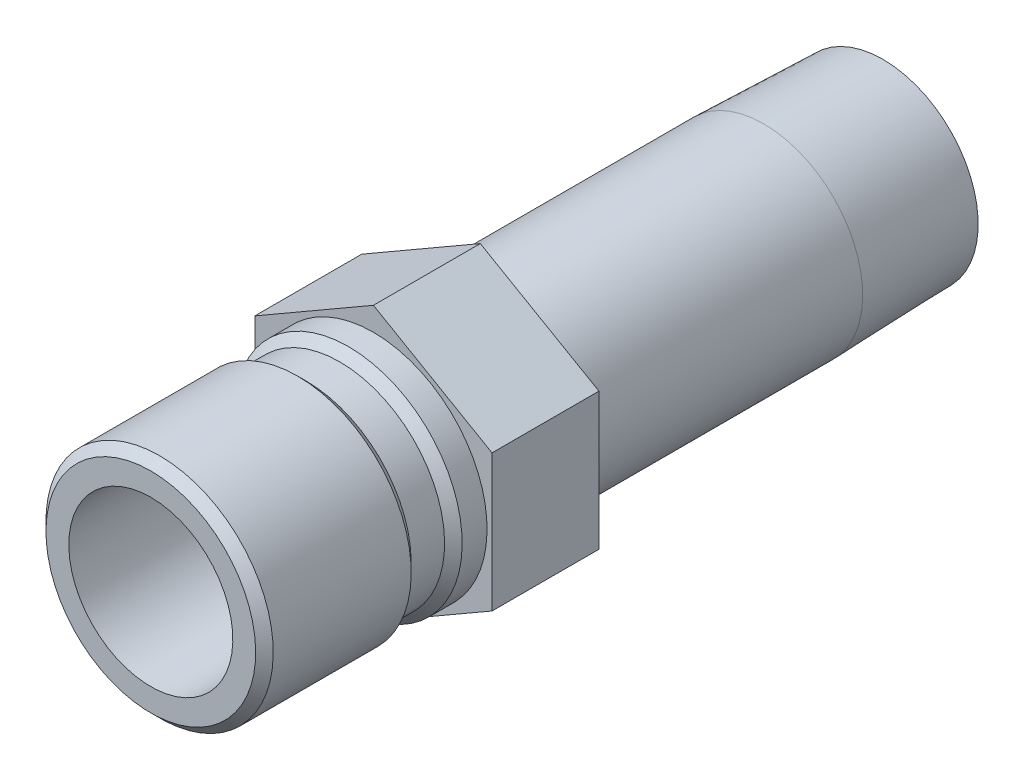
ISO-10303-21;
HEADER;
FILE_DESCRIPTION(('STEP AP214'),'2;1');
FILE_NAME('part.step','',(''),(''),'','','');
FILE_SCHEMA(('AUTOMOTIVE_DESIGN { 1 0 10303 214 1 1 1 1 }'));
ENDSEC;
DATA;
#1=APPLICATION_CONTEXT('core data for automotive mechanical design processes');
#2=APPLICATION_PROTOCOL_DEFINITION('international standard','automotive_design',2000,#1);
#3=PRODUCT_CONTEXT('',#1,'mechanical');
#4=PRODUCT('Part','Part','',(#3));
#5=PRODUCT_RELATED_PRODUCT_CATEGORY('part','',(#4));
#6=PRODUCT_DEFINITION_FORMATION('','',#4);
#7=PRODUCT_DEFINITION_CONTEXT('part definition',#1,'design');
#8=PRODUCT_DEFINITION('design','',#6,#7);
#9=PRODUCT_DEFINITION_SHAPE('','',#8);
#10=(LENGTH_UNIT() NAMED_UNIT(*) SI_UNIT(.MILLI.,.METRE.));
#11=(NAMED_UNIT(*) PLANE_ANGLE_UNIT() SI_UNIT($,.RADIAN.));
#12=(NAMED_UNIT(*) SI_UNIT($,.STERADIAN.) SOLID_ANGLE_UNIT());
#13=UNCERTAINTY_MEASURE_WITH_UNIT(LENGTH_MEASURE(1.E-05),#10,'distance_accuracy_value','');
#14=(GEOMETRIC_REPRESENTATION_CONTEXT(3) GLOBAL_UNCERTAINTY_ASSIGNED_CONTEXT((#13)) GLOBAL_UNIT_ASSIGNED_CONTEXT((#10,
#11,#12)) REPRESENTATION_CONTEXT('',''));
#15=CARTESIAN_POINT('',(0.,0.,0.));
#16=DIRECTION('',(0.,0.,1.));
#17=DIRECTION('',(1.,0.,0.));
#18=AXIS2_PLACEMENT_3D('',#15,#16,#17);
#19=CARTESIAN_POINT('',(0.,0.,0.));
#20=DIRECTION('',(0.,0.,-1.));
#21=DIRECTION('',(0.,1.,0.));
#22=AXIS2_PLACEMENT_3D('',#19,#20,#21);
#23=CYLINDRICAL_SURFACE('',#22,8.5725);
#24=CARTESIAN_POINT('',(0.,0.,-33.8582));
#25=DIRECTION('',(0.,0.,-1.));
#26=DIRECTION('',(0.,1.,0.));
#27=AXIS2_PLACEMENT_3D('',#24,#25,#26);
#28=CIRCLE('',#27,8.5725);
#29=CARTESIAN_POINT('',(0.,8.5725,-33.8582));
#30=VERTEX_POINT('',#29);
#31=EDGE_CURVE('E158',#30,#30,#28,.T.);
#32=ORIENTED_EDGE('',*,*,#31,.F.);
#33=EDGE_LOOP('',(#32));
#34=FACE_BOUND('',#33,.T.);
#35=CARTESIAN_POINT('',(0.,0.,-9.271));
#36=DIRECTION('',(0.,0.,1.));
#37=DIRECTION('',(1.,0.,0.));
#38=AXIS2_PLACEMENT_3D('',#35,#36,#37);
#39=CIRCLE('',#38,8.5725);
#40=CARTESIAN_POINT('',(8.5725,0.,-9.271));
#41=VERTEX_POINT('',#40);
#42=EDGE_CURVE('E39',#41,#41,#39,.F.);
#43=ORIENTED_EDGE('',*,*,#42,.T.);
#44=EDGE_LOOP('',(#43));
#45=FACE_BOUND('',#44,.T.);
#46=ADVANCED_FACE('F35',(#34,#45),#23,.T.);
#47=CARTESIAN_POINT('',(0.,0.,0.));
#48=DIRECTION('',(0.,0.,-1.));
#49=DIRECTION('',(0.,1.,0.));
#50=AXIS2_PLACEMENT_3D('',#47,#48,#49);
#51=CYLINDRICAL_SURFACE('',#50,7.112);
#52=CARTESIAN_POINT('',(0.,0.,1.524));
#53=DIRECTION('',(0.,0.,-1.));
#54=DIRECTION('',(0.,1.,0.));
#55=AXIS2_PLACEMENT_3D('',#52,#53,#54);
#56=CIRCLE('',#55,7.112);
#57=CARTESIAN_POINT('',(0.,7.112,1.524));
#58=VERTEX_POINT('',#57);
#59=EDGE_CURVE('E146',#58,#58,#56,.T.);
#60=ORIENTED_EDGE('',*,*,#59,.T.);
#61=EDGE_LOOP('',(#60));
#62=FACE_BOUND('',#61,.T.);
#63=CARTESIAN_POINT('',(0.,0.,19.304));
#64=DIRECTION('',(0.,0.,-1.));
#65=DIRECTION('',(0.,1.,0.));
#66=AXIS2_PLACEMENT_3D('',#63,#64,#65);
#67=CIRCLE('',#66,7.112);
#68=CARTESIAN_POINT('',(0.,7.112,19.304));
#69=VERTEX_POINT('',#68);
#70=EDGE_CURVE('E11',#69,#69,#67,.T.);
#71=ORIENTED_EDGE('',*,*,#70,.F.);
#72=EDGE_LOOP('',(#71));
#73=FACE_BOUND('',#72,.T.);
#74=ADVANCED_FACE('F37',(#62,#73),#51,.F.);
#75=CARTESIAN_POINT('',(0.,7.112,19.304));
#76=DIRECTION('',(0.,0.,1.));
#77=DIRECTION('',(0.,-1.,0.));
#78=AXIS2_PLACEMENT_3D('',#75,#76,#77);
#79=PLANE('',#78);
#80=ORIENTED_EDGE('',*,*,#70,.T.);
#81=EDGE_LOOP('',(#80));
#82=FACE_BOUND('',#81,.T.);
#83=CARTESIAN_POINT('',(0.,0.,19.304));
#84=DIRECTION('',(0.,0.,-1.));
#85=DIRECTION('',(0.,1.,0.));
#86=AXIS2_PLACEMENT_3D('',#83,#84,#85);
#87=CIRCLE('',#86,9.09319999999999);
#88=CARTESIAN_POINT('',(0.,9.0932,19.304));
#89=VERTEX_POINT('',#88);
#90=EDGE_CURVE('E45',#89,#89,#87,.T.);
#91=ORIENTED_EDGE('',*,*,#90,.F.);
#92=EDGE_LOOP('',(#91));
#93=FACE_BOUND('',#92,.T.);
#94=ADVANCED_FACE('F185',(#82,#93),#79,.T.);
#95=CARTESIAN_POINT('',(0.,0.,18.542));
#96=DIRECTION('',(0.,0.,-1.));
#97=DIRECTION('',(0.,1.,0.));
#98=AXIS2_PLACEMENT_3D('',#95,#96,#97);
#99=CONICAL_SURFACE('',#98,9.8552,0.785398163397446);
#100=ORIENTED_EDGE('',*,*,#90,.T.);
#101=EDGE_LOOP('',(#100));
#102=FACE_BOUND('',#101,.T.);
#103=CARTESIAN_POINT('',(0.,0.,18.542));
#104=DIRECTION('',(0.,0.,-1.));
#105=DIRECTION('',(0.,1.,0.));
#106=AXIS2_PLACEMENT_3D('',#103,#104,#105);
#107=CIRCLE('',#106,9.8552);
#108=CARTESIAN_POINT('',(0.,9.8552,18.542));
#109=VERTEX_POINT('',#108);
#110=EDGE_CURVE('E176',#109,#109,#107,.T.);
#111=ORIENTED_EDGE('',*,*,#110,.F.);
#112=EDGE_LOOP('',(#111));
#113=FACE_BOUND('',#112,.T.);
#114=ADVANCED_FACE('F182',(#102,#113),#99,.T.);
#115=CARTESIAN_POINT('',(0.,0.,0.));
#116=DIRECTION('',(0.,0.,-1.));
#117=DIRECTION('',(0.,1.,0.));
#118=AXIS2_PLACEMENT_3D('',#115,#116,#117);
#119=CYLINDRICAL_SURFACE('',#118,9.8552);
#120=ORIENTED_EDGE('',*,*,#110,.T.);
#121=EDGE_LOOP('',(#120));
#122=FACE_BOUND('',#121,.T.);
#123=CARTESIAN_POINT('',(0.,0.,6.5786));
#124=DIRECTION('',(0.,0.,-1.));
#125=DIRECTION('',(0.,1.,0.));
#126=AXIS2_PLACEMENT_3D('',#123,#124,#125);
#127=CIRCLE('',#126,9.8552);
#128=CARTESIAN_POINT('',(0.,9.8552,6.5786));
#129=VERTEX_POINT('',#128);
#130=EDGE_CURVE('E173',#129,#129,#127,.T.);
#131=ORIENTED_EDGE('',*,*,#130,.F.);
#132=EDGE_LOOP('',(#131));
#133=FACE_BOUND('',#132,.T.);
#134=ADVANCED_FACE('F192',(#122,#133),#119,.T.);
#135=CARTESIAN_POINT('',(0.,0.,5.8166));
#136=DIRECTION('',(0.,0.,1.));
#137=DIRECTION('',(0.,-1.,0.));
#138=AXIS2_PLACEMENT_3D('',#135,#136,#137);
#139=CONICAL_SURFACE('',#138,9.0932,0.785398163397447);
#140=ORIENTED_EDGE('',*,*,#130,.T.);
#141=EDGE_LOOP('',(#140));
#142=FACE_BOUND('',#141,.T.);
#143=CARTESIAN_POINT('',(0.,0.,5.8166));
#144=DIRECTION('',(0.,0.,-1.));
#145=DIRECTION('',(0.,1.,0.));
#146=AXIS2_PLACEMENT_3D('',#143,#144,#145);
#147=CIRCLE('',#146,9.0932);
#148=CARTESIAN_POINT('',(0.,9.0932,5.8166));
#149=VERTEX_POINT('',#148);
#150=EDGE_CURVE('E170',#149,#149,#147,.T.);
#151=ORIENTED_EDGE('',*,*,#150,.F.);
#152=EDGE_LOOP('',(#151));
#153=FACE_BOUND('',#152,.T.);
#154=ADVANCED_FACE('F217',(#142,#153),#139,.T.);
#155=CARTESIAN_POINT('',(0.,0.,0.));
#156=DIRECTION('',(0.,0.,-1.));
#157=DIRECTION('',(0.,1.,0.));
#158=AXIS2_PLACEMENT_3D('',#155,#156,#157);
#159=CYLINDRICAL_SURFACE('',#158,9.0932);
#160=ORIENTED_EDGE('',*,*,#150,.T.);
#161=EDGE_LOOP('',(#160));
#162=FACE_BOUND('',#161,.T.);
#163=CARTESIAN_POINT('',(0.,0.,2.921));
#164=DIRECTION('',(0.,0.,-1.));
#165=DIRECTION('',(0.,1.,0.));
#166=AXIS2_PLACEMENT_3D('',#163,#164,#165);
#167=CIRCLE('',#166,9.0932);
#168=CARTESIAN_POINT('',(0.,9.0932,2.921));
#169=VERTEX_POINT('',#168);
#170=EDGE_CURVE('E167',#169,#169,#167,.T.);
#171=ORIENTED_EDGE('',*,*,#170,.F.);
#172=EDGE_LOOP('',(#171));
#173=FACE_BOUND('',#172,.T.);
#174=ADVANCED_FACE('F213',(#162,#173),#159,.T.);
#175=CARTESIAN_POINT('',(0.,0.,2.159));
#176=DIRECTION('',(0.,0.,-1.));
#177=DIRECTION('',(0.,1.,0.));
#178=AXIS2_PLACEMENT_3D('',#175,#176,#177);
#179=CONICAL_SURFACE('',#178,9.8552,0.785398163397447);
#180=ORIENTED_EDGE('',*,*,#170,.T.);
#181=EDGE_LOOP('',(#180));
#182=FACE_BOUND('',#181,.T.);
#183=CARTESIAN_POINT('',(0.,0.,2.159));
#184=DIRECTION('',(0.,0.,-1.));
#185=DIRECTION('',(0.,1.,0.));
#186=AXIS2_PLACEMENT_3D('',#183,#184,#185);
#187=CIRCLE('',#186,9.8552);
#188=CARTESIAN_POINT('',(0.,9.8552,2.159));
#189=VERTEX_POINT('',#188);
#190=EDGE_CURVE('E164',#189,#189,#187,.T.);
#191=ORIENTED_EDGE('',*,*,#190,.F.);
#192=EDGE_LOOP('',(#191));
#193=FACE_BOUND('',#192,.T.);
#194=ADVANCED_FACE('F209',(#182,#193),#179,.T.);
#195=CARTESIAN_POINT('',(0.,0.,0.));
#196=DIRECTION('',(0.,0.,-1.));
#197=DIRECTION('',(0.,1.,0.));
#198=AXIS2_PLACEMENT_3D('',#195,#196,#197);
#199=CYLINDRICAL_SURFACE('',#198,9.8552);
#200=ORIENTED_EDGE('',*,*,#190,.T.);
#201=EDGE_LOOP('',(#200));
#202=FACE_BOUND('',#201,.T.);
#203=CARTESIAN_POINT('',(0.,0.,0.));
#204=DIRECTION('',(0.,0.,-1.));
#205=DIRECTION('',(0.,1.,0.));
#206=AXIS2_PLACEMENT_3D('',#203,#204,#205);
#207=CIRCLE('',#206,9.8552);
#208=CARTESIAN_POINT('',(0.,9.8552,0.));
#209=VERTEX_POINT('',#208);
#210=EDGE_CURVE('E161',#209,#209,#207,.T.);
#211=ORIENTED_EDGE('',*,*,#210,.F.);
#212=EDGE_LOOP('',(#211));
#213=FACE_BOUND('',#212,.T.);
#214=ADVANCED_FACE('F206',(#202,#213),#199,.T.);
#215=CARTESIAN_POINT('',(0.,0.,-44.196));
#216=DIRECTION('',(0.,0.,1.));
#217=DIRECTION('',(0.,-1.,0.));
#218=AXIS2_PLACEMENT_3D('',#215,#216,#217);
#219=CONICAL_SURFACE('',#218,8.24944566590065,0.0312396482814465);
#220=ORIENTED_EDGE('',*,*,#31,.T.);
#221=EDGE_LOOP('',(#220));
#222=FACE_BOUND('',#221,.T.);
#223=CARTESIAN_POINT('',(0.,0.,-44.196));
#224=DIRECTION('',(0.,0.,-1.));
#225=DIRECTION('',(0.,1.,0.));
#226=AXIS2_PLACEMENT_3D('',#223,#224,#225);
#227=CIRCLE('',#226,8.24944566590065);
#228=CARTESIAN_POINT('',(0.,8.24944566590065,-44.196));
#229=VERTEX_POINT('',#228);
#230=EDGE_CURVE('E155',#229,#229,#227,.T.);
#231=ORIENTED_EDGE('',*,*,#230,.F.);
#232=EDGE_LOOP('',(#231));
#233=FACE_BOUND('',#232,.T.);
#234=ADVANCED_FACE('F204',(#222,#233),#219,.T.);
#235=CARTESIAN_POINT('',(0.,8.24944566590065,-44.196));
#236=DIRECTION('',(0.,0.,-1.));
#237=DIRECTION('',(0.,1.,0.));
#238=AXIS2_PLACEMENT_3D('',#235,#236,#237);
#239=PLANE('',#238);
#240=ORIENTED_EDGE('',*,*,#230,.T.);
#241=EDGE_LOOP('',(#240));
#242=FACE_BOUND('',#241,.T.);
#243=CARTESIAN_POINT('',(0.,0.,-44.196));
#244=DIRECTION('',(0.,0.,-1.));
#245=DIRECTION('',(0.,1.,0.));
#246=AXIS2_PLACEMENT_3D('',#243,#244,#245);
#247=CIRCLE('',#246,6.2611);
#248=CARTESIAN_POINT('',(0.,6.2611,-44.196));
#249=VERTEX_POINT('',#248);
#250=EDGE_CURVE('E152',#249,#249,#247,.T.);
#251=ORIENTED_EDGE('',*,*,#250,.F.);
#252=EDGE_LOOP('',(#251));
#253=FACE_BOUND('',#252,.T.);
#254=ADVANCED_FACE('F270',(#242,#253),#239,.T.);
#255=CARTESIAN_POINT('',(0.,0.,0.));
#256=DIRECTION('',(0.,0.,-1.));
#257=DIRECTION('',(0.,1.,0.));
#258=AXIS2_PLACEMENT_3D('',#255,#256,#257);
#259=CYLINDRICAL_SURFACE('',#258,6.2611);
#260=ORIENTED_EDGE('',*,*,#250,.T.);
#261=EDGE_LOOP('',(#260));
#262=FACE_BOUND('',#261,.T.);
#263=CARTESIAN_POINT('',(0.,0.,1.07156844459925));
#264=DIRECTION('',(0.,0.,-1.));
#265=DIRECTION('',(0.,1.,0.));
#266=AXIS2_PLACEMENT_3D('',#263,#264,#265);
#267=CIRCLE('',#266,6.2611);
#268=CARTESIAN_POINT('',(0.,6.2611,1.07156844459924));
#269=VERTEX_POINT('',#268);
#270=EDGE_CURVE('E149',#269,#269,#267,.T.);
#271=ORIENTED_EDGE('',*,*,#270,.F.);
#272=EDGE_LOOP('',(#271));
#273=FACE_BOUND('',#272,.T.);
#274=ADVANCED_FACE('F267',(#262,#273),#259,.F.);
#275=CARTESIAN_POINT('',(0.,0.,1.524));
#276=DIRECTION('',(0.,0.,1.));
#277=DIRECTION('',(0.,-1.,0.));
#278=AXIS2_PLACEMENT_3D('',#275,#276,#277);
#279=CONICAL_SURFACE('',#278,7.112,1.08210413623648);
#280=ORIENTED_EDGE('',*,*,#270,.T.);
#281=EDGE_LOOP('',(#280));
#282=FACE_BOUND('',#281,.T.);
#283=ORIENTED_EDGE('',*,*,#59,.F.);
#284=EDGE_LOOP('',(#283));
#285=FACE_BOUND('',#284,.T.);
#286=ADVANCED_FACE('F255',(#282,#285),#279,.F.);
#287=CARTESIAN_POINT('',(0.,11.8784044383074,-9.271));
#288=DIRECTION('',(-0.5,0.866025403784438,0.));
#289=DIRECTION('',(-0.866025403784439,-0.5,0.));
#290=AXIS2_PLACEMENT_3D('',#287,#288,#289);
#291=PLANE('',#290);
#292=DIRECTION('',(-0.866025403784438,-0.5,0.));
#293=VECTOR('',#292,1.);
#294=CARTESIAN_POINT('',(0.,11.8784044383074,0.));
#295=LINE('',#294,#293);
#296=CARTESIAN_POINT('',(0.,11.8784044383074,0.));
#297=VERTEX_POINT('',#296);
#298=CARTESIAN_POINT('',(-10.287,5.93920221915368,0.));
#299=VERTEX_POINT('',#298);
#300=EDGE_CURVE('E124',#297,#299,#295,.T.);
#301=ORIENTED_EDGE('',*,*,#300,.F.);
#302=DIRECTION('',(0.,0.,1.));
#303=VECTOR('',#302,1.);
#304=CARTESIAN_POINT('',(0.,11.8784044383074,-9.271));
#305=LINE('',#304,#303);
#306=CARTESIAN_POINT('',(0.,11.8784044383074,-9.271));
#307=VERTEX_POINT('',#306);
#308=EDGE_CURVE('E53',#307,#297,#305,.T.);
#309=ORIENTED_EDGE('',*,*,#308,.F.);
#310=DIRECTION('',(-0.866025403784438,-0.5,0.));
#311=VECTOR('',#310,1.);
#312=CARTESIAN_POINT('',(0.,11.8784044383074,-9.271));
#313=LINE('',#312,#311);
#314=CARTESIAN_POINT('',(-10.287,5.93920221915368,-9.271));
#315=VERTEX_POINT('',#314);
#316=EDGE_CURVE('E139',#307,#315,#313,.T.);
#317=ORIENTED_EDGE('',*,*,#316,.T.);
#318=DIRECTION('',(0.,0.,1.));
#319=VECTOR('',#318,1.);
#320=CARTESIAN_POINT('',(-10.287,5.93920221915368,-9.271));
#321=LINE('',#320,#319);
#322=EDGE_CURVE('E88',#315,#299,#321,.T.);
#323=ORIENTED_EDGE('',*,*,#322,.T.);
#324=EDGE_LOOP('',(#301,#309,#317,#323));
#325=FACE_BOUND('',#324,.T.);
#326=ADVANCED_FACE('F242',(#325),#291,.T.);
#327=CARTESIAN_POINT('',(10.287,5.93920221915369,-9.271));
#328=DIRECTION('',(0.5,0.866025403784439,0.));
#329=DIRECTION('',(-0.866025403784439,0.5,0.));
#330=AXIS2_PLACEMENT_3D('',#327,#328,#329);
#331=PLANE('',#330);
#332=DIRECTION('',(-0.866025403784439,0.5,0.));
#333=VECTOR('',#332,1.);
#334=CARTESIAN_POINT('',(10.287,5.93920221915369,0.));
#335=LINE('',#334,#333);
#336=CARTESIAN_POINT('',(10.287,5.93920221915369,0.));
#337=VERTEX_POINT('',#336);
#338=EDGE_CURVE('E136',#337,#297,#335,.T.);
#339=ORIENTED_EDGE('',*,*,#338,.F.);
#340=DIRECTION('',(0.,0.,1.));
#341=VECTOR('',#340,1.);
#342=CARTESIAN_POINT('',(10.287,5.93920221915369,-9.271));
#343=LINE('',#342,#341);
#344=CARTESIAN_POINT('',(10.287,5.93920221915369,-9.271));
#345=VERTEX_POINT('',#344);
#346=EDGE_CURVE('E76',#345,#337,#343,.T.);
#347=ORIENTED_EDGE('',*,*,#346,.F.);
#348=DIRECTION('',(-0.866025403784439,0.5,0.));
#349=VECTOR('',#348,1.);
#350=CARTESIAN_POINT('',(10.287,5.93920221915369,-9.271));
#351=LINE('',#350,#349);
#352=EDGE_CURVE('E114',#345,#307,#351,.T.);
#353=ORIENTED_EDGE('',*,*,#352,.T.);
#354=ORIENTED_EDGE('',*,*,#308,.T.);
#355=EDGE_LOOP('',(#339,#347,#353,#354));
#356=FACE_BOUND('',#355,.T.);
#357=ADVANCED_FACE('F247',(#356),#331,.T.);
#358=CARTESIAN_POINT('',(10.287,-5.93920221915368,-9.271));
#359=DIRECTION('',(1.,0.,0.));
#360=DIRECTION('',(0.,0.,-1.));
#361=AXIS2_PLACEMENT_3D('',#358,#359,#360);
#362=PLANE('',#361);
#363=DIRECTION('',(0.,1.,0.));
#364=VECTOR('',#363,1.);
#365=CARTESIAN_POINT('',(10.287,-5.93920221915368,0.));
#366=LINE('',#365,#364);
#367=CARTESIAN_POINT('',(10.287,-5.93920221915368,0.));
#368=VERTEX_POINT('',#367);
#369=EDGE_CURVE('E101',#368,#337,#366,.T.);
#370=ORIENTED_EDGE('',*,*,#369,.F.);
#371=DIRECTION('',(0.,0.,1.));
#372=VECTOR('',#371,1.);
#373=CARTESIAN_POINT('',(10.287,-5.93920221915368,-9.271));
#374=LINE('',#373,#372);
#375=CARTESIAN_POINT('',(10.287,-5.93920221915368,-9.271));
#376=VERTEX_POINT('',#375);
#377=EDGE_CURVE('E96',#376,#368,#374,.T.);
#378=ORIENTED_EDGE('',*,*,#377,.F.);
#379=DIRECTION('',(0.,1.,0.));
#380=VECTOR('',#379,1.);
#381=CARTESIAN_POINT('',(10.287,-5.93920221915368,-9.271));
#382=LINE('',#381,#380);
#383=EDGE_CURVE('E99',#376,#345,#382,.T.);
#384=ORIENTED_EDGE('',*,*,#383,.T.);
#385=ORIENTED_EDGE('',*,*,#346,.T.);
#386=EDGE_LOOP('',(#370,#378,#384,#385));
#387=FACE_BOUND('',#386,.T.);
#388=ADVANCED_FACE('F98',(#387),#362,.T.);
#389=CARTESIAN_POINT('',(0.,-11.8784044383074,-9.271));
#390=DIRECTION('',(0.5,-0.866025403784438,0.));
#391=DIRECTION('',(0.866025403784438,0.5,0.));
#392=AXIS2_PLACEMENT_3D('',#389,#390,#391);
#393=PLANE('',#392);
#394=DIRECTION('',(0.866025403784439,0.5,0.));
#395=VECTOR('',#394,1.);
#396=CARTESIAN_POINT('',(0.,-11.8784044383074,0.));
#397=LINE('',#396,#395);
#398=CARTESIAN_POINT('',(0.,-11.8784044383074,0.));
#399=VERTEX_POINT('',#398);
#400=EDGE_CURVE('E133',#399,#368,#397,.T.);
#401=ORIENTED_EDGE('',*,*,#400,.F.);
#402=DIRECTION('',(0.,0.,1.));
#403=VECTOR('',#402,1.);
#404=CARTESIAN_POINT('',(0.,-11.8784044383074,-9.271));
#405=LINE('',#404,#403);
#406=CARTESIAN_POINT('',(0.,-11.8784044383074,-9.271));
#407=VERTEX_POINT('',#406);
#408=EDGE_CURVE('E106',#407,#399,#405,.T.);
#409=ORIENTED_EDGE('',*,*,#408,.F.);
#410=DIRECTION('',(0.866025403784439,0.5,0.));
#411=VECTOR('',#410,1.);
#412=CARTESIAN_POINT('',(0.,-11.8784044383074,-9.271));
#413=LINE('',#412,#411);
#414=EDGE_CURVE('E112',#407,#376,#413,.T.);
#415=ORIENTED_EDGE('',*,*,#414,.T.);
#416=ORIENTED_EDGE('',*,*,#377,.T.);
#417=EDGE_LOOP('',(#401,#409,#415,#416));
#418=FACE_BOUND('',#417,.T.);
#419=ADVANCED_FACE('F116',(#418),#393,.T.);
#420=CARTESIAN_POINT('',(-10.287,-5.93920221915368,-9.271));
#421=DIRECTION('',(-0.5,-0.866025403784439,0.));
#422=DIRECTION('',(0.866025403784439,-0.5,0.));
#423=AXIS2_PLACEMENT_3D('',#420,#421,#422);
#424=PLANE('',#423);
#425=DIRECTION('',(0.866025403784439,-0.5,0.));
#426=VECTOR('',#425,1.);
#427=CARTESIAN_POINT('',(-10.287,-5.93920221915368,0.));
#428=LINE('',#427,#426);
#429=CARTESIAN_POINT('',(-10.287,-5.93920221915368,0.));
#430=VERTEX_POINT('',#429);
#431=EDGE_CURVE('E130',#430,#399,#428,.T.);
#432=ORIENTED_EDGE('',*,*,#431,.F.);
#433=DIRECTION('',(0.,0.,1.));
#434=VECTOR('',#433,1.);
#435=CARTESIAN_POINT('',(-10.287,-5.93920221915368,-9.271));
#436=LINE('',#435,#434);
#437=CARTESIAN_POINT('',(-10.287,-5.93920221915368,-9.271));
#438=VERTEX_POINT('',#437);
#439=EDGE_CURVE('E143',#438,#430,#436,.T.);
#440=ORIENTED_EDGE('',*,*,#439,.F.);
#441=DIRECTION('',(0.866025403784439,-0.5,0.));
#442=VECTOR('',#441,1.);
#443=CARTESIAN_POINT('',(-10.287,-5.93920221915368,-9.271));
#444=LINE('',#443,#442);
#445=EDGE_CURVE('E117',#438,#407,#444,.T.);
#446=ORIENTED_EDGE('',*,*,#445,.T.);
#447=ORIENTED_EDGE('',*,*,#408,.T.);
#448=EDGE_LOOP('',(#432,#440,#446,#447));
#449=FACE_BOUND('',#448,.T.);
#450=ADVANCED_FACE('F246',(#449),#424,.T.);
#451=CARTESIAN_POINT('',(-10.287,5.93920221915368,-9.271));
#452=DIRECTION('',(-1.,0.,0.));
#453=DIRECTION('',(0.,0.,1.));
#454=AXIS2_PLACEMENT_3D('',#451,#452,#453);
#455=PLANE('',#454);
#456=DIRECTION('',(0.,-1.,0.));
#457=VECTOR('',#456,1.);
#458=CARTESIAN_POINT('',(-10.287,5.93920221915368,0.));
#459=LINE('',#458,#457);
#460=EDGE_CURVE('E127',#299,#430,#459,.T.);
#461=ORIENTED_EDGE('',*,*,#460,.F.);
#462=ORIENTED_EDGE('',*,*,#322,.F.);
#463=DIRECTION('',(0.,-1.,0.));
#464=VECTOR('',#463,1.);
#465=CARTESIAN_POINT('',(-10.287,5.93920221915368,-9.271));
#466=LINE('',#465,#464);
#467=EDGE_CURVE('E119',#315,#438,#466,.T.);
#468=ORIENTED_EDGE('',*,*,#467,.T.);
#469=ORIENTED_EDGE('',*,*,#439,.T.);
#470=EDGE_LOOP('',(#461,#462,#468,#469));
#471=FACE_BOUND('',#470,.T.);
#472=ADVANCED_FACE('F243',(#471),#455,.T.);
#473=CARTESIAN_POINT('',(-10.287,5.93920221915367,-9.271));
#474=DIRECTION('',(0.,0.,1.));
#475=DIRECTION('',(1.,0.,0.));
#476=AXIS2_PLACEMENT_3D('',#473,#474,#475);
#477=PLANE('',#476);
#478=ORIENTED_EDGE('',*,*,#42,.F.);
#479=EDGE_LOOP('',(#478));
#480=FACE_BOUND('',#479,.T.);
#481=ORIENTED_EDGE('',*,*,#316,.F.);
#482=ORIENTED_EDGE('',*,*,#352,.F.);
#483=ORIENTED_EDGE('',*,*,#383,.F.);
#484=ORIENTED_EDGE('',*,*,#414,.F.);
#485=ORIENTED_EDGE('',*,*,#445,.F.);
#486=ORIENTED_EDGE('',*,*,#467,.F.);
#487=EDGE_LOOP('',(#481,#482,#483,#484,#485,#486));
#488=FACE_BOUND('',#487,.T.);
#489=ADVANCED_FACE('F110',(#480,#488),#477,.F.);
#490=CARTESIAN_POINT('',(-10.287,5.93920221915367,0.));
#491=DIRECTION('',(0.,0.,1.));
#492=DIRECTION('',(1.,0.,0.));
#493=AXIS2_PLACEMENT_3D('',#490,#491,#492);
#494=PLANE('',#493);
#495=ORIENTED_EDGE('',*,*,#210,.T.);
#496=EDGE_LOOP('',(#495));
#497=FACE_BOUND('',#496,.T.);
#498=ORIENTED_EDGE('',*,*,#300,.T.);
#499=ORIENTED_EDGE('',*,*,#460,.T.);
#500=ORIENTED_EDGE('',*,*,#431,.T.);
#501=ORIENTED_EDGE('',*,*,#400,.T.);
#502=ORIENTED_EDGE('',*,*,#369,.T.);
#503=ORIENTED_EDGE('',*,*,#338,.T.);
#504=EDGE_LOOP('',(#498,#499,#500,#501,#502,#503));
#505=FACE_BOUND('',#504,.T.);
#506=ADVANCED_FACE('F238',(#497,#505),#494,.T.);
#507=CLOSED_SHELL('',(#46,#74,#94,#114,#134,#154,#174,#194,#214,#234,#254,#274,#286,#326,#357,
#388,#419,#450,#472,#489,#506));
#508=MANIFOLD_SOLID_BREP('B2',#507);
#509=ADVANCED_BREP_SHAPE_REPRESENTATION('',(#18,#508),#14);
#510=SHAPE_DEFINITION_REPRESENTATION(#9,#509);
ENDSEC;
END-ISO-10303-21;
